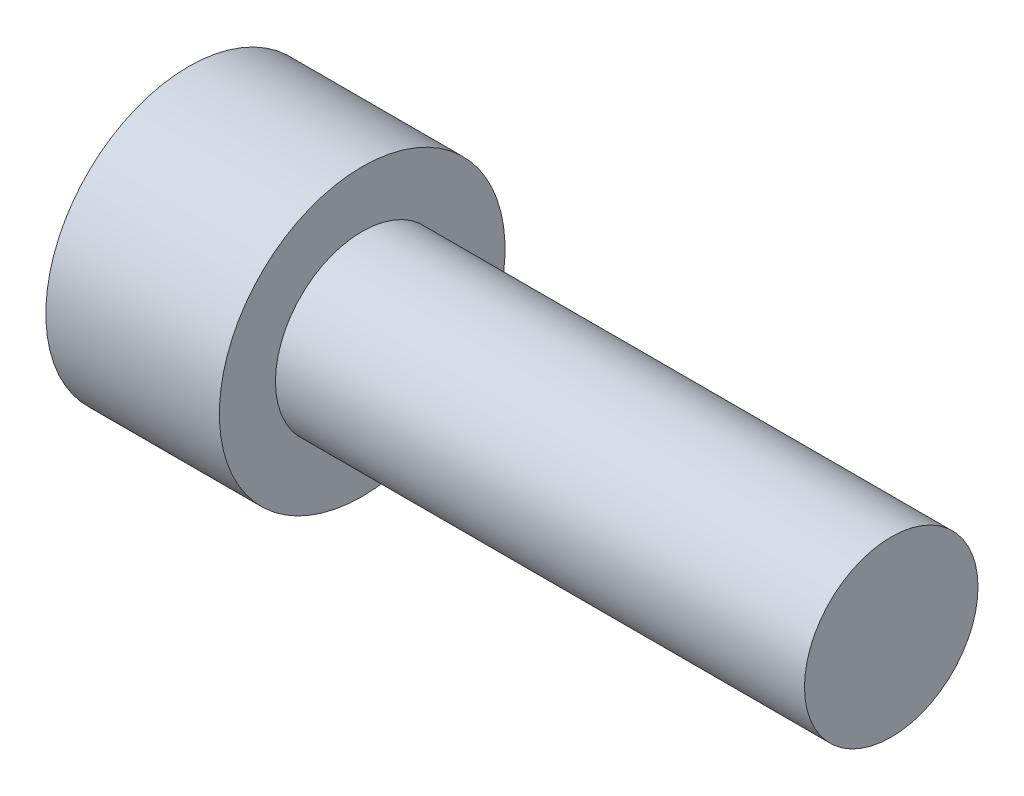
from build123d import *

# Parameters (mm, degrees)
CUT_EXTRUDE1_DEPTH = 2.794


with BuildPart() as part:
    # Sketch1 → Revolve1 (revolve)
    with BuildSketch(Plane.XY):
        Polygon((16.8656, 0), (0, 0), (0, 3.429), (4.1656, 3.429), (4.1656, 2.0828), (16.8656, 2.0828), align=None)
    revolve(axis=Axis((16.8656, 0, 0), (-1, 0, 0)))

    # Sketch2 → Cut-Extrude1 (cut)
    with BuildSketch(Plane.ZY):
        Polygon((2.062222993, 0), (1.031111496, 1.7859375), (-1.031111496, 1.7859375), (-2.062222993, 0), (-1.031111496, -1.7859375), (1.031111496, -1.7859375), align=None)
    extrude(amount=-CUT_EXTRUDE1_DEPTH, mode=Mode.SUBTRACT)


solid = part.part
